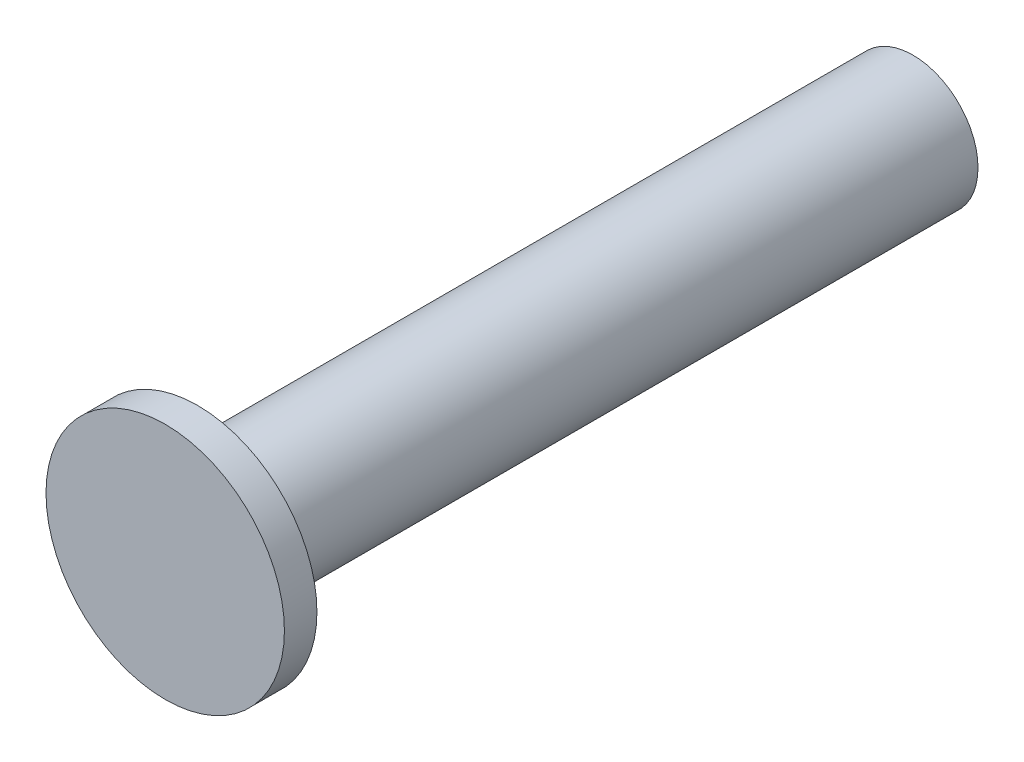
ISO-10303-21;
HEADER;
FILE_DESCRIPTION(('STEP AP214'),'2;1');
FILE_NAME('part.step','',(''),(''),'','','');
FILE_SCHEMA(('AUTOMOTIVE_DESIGN { 1 0 10303 214 1 1 1 1 }'));
ENDSEC;
DATA;
#1=APPLICATION_CONTEXT('core data for automotive mechanical design processes');
#2=APPLICATION_PROTOCOL_DEFINITION('international standard','automotive_design',2000,#1);
#3=PRODUCT_CONTEXT('',#1,'mechanical');
#4=PRODUCT('Part','Part','',(#3));
#5=PRODUCT_RELATED_PRODUCT_CATEGORY('part','',(#4));
#6=PRODUCT_DEFINITION_FORMATION('','',#4);
#7=PRODUCT_DEFINITION_CONTEXT('part definition',#1,'design');
#8=PRODUCT_DEFINITION('design','',#6,#7);
#9=PRODUCT_DEFINITION_SHAPE('','',#8);
#10=(LENGTH_UNIT() NAMED_UNIT(*) SI_UNIT(.MILLI.,.METRE.));
#11=(NAMED_UNIT(*) PLANE_ANGLE_UNIT() SI_UNIT($,.RADIAN.));
#12=(NAMED_UNIT(*) SI_UNIT($,.STERADIAN.) SOLID_ANGLE_UNIT());
#13=UNCERTAINTY_MEASURE_WITH_UNIT(LENGTH_MEASURE(1.E-05),#10,'distance_accuracy_value','');
#14=(GEOMETRIC_REPRESENTATION_CONTEXT(3) GLOBAL_UNCERTAINTY_ASSIGNED_CONTEXT((#13)) GLOBAL_UNIT_ASSIGNED_CONTEXT((#10,
#11,#12)) REPRESENTATION_CONTEXT('',''));
#15=CARTESIAN_POINT('',(0.,0.,0.));
#16=DIRECTION('',(0.,0.,1.));
#17=DIRECTION('',(1.,0.,0.));
#18=AXIS2_PLACEMENT_3D('',#15,#16,#17);
#19=CARTESIAN_POINT('',(0.,0.,33.));
#20=DIRECTION('',(0.,0.,-1.));
#21=DIRECTION('',(-1.,0.,0.));
#22=AXIS2_PLACEMENT_3D('',#19,#20,#21);
#23=CYLINDRICAL_SURFACE('',#22,3.);
#24=CARTESIAN_POINT('',(0.,0.,33.));
#25=DIRECTION('',(0.,0.,1.));
#26=DIRECTION('',(1.,0.,0.));
#27=AXIS2_PLACEMENT_3D('',#24,#25,#26);
#28=CIRCLE('',#27,3.);
#29=CARTESIAN_POINT('',(3.,0.,33.));
#30=VERTEX_POINT('',#29);
#31=EDGE_CURVE('E10',#30,#30,#28,.T.);
#32=ORIENTED_EDGE('',*,*,#31,.F.);
#33=EDGE_LOOP('',(#32));
#34=FACE_BOUND('',#33,.T.);
#35=CARTESIAN_POINT('',(0.,0.,0.));
#36=DIRECTION('',(0.,0.,1.));
#37=DIRECTION('',(1.,0.,0.));
#38=AXIS2_PLACEMENT_3D('',#35,#36,#37);
#39=CIRCLE('',#38,3.);
#40=CARTESIAN_POINT('',(3.,0.,0.));
#41=VERTEX_POINT('',#40);
#42=EDGE_CURVE('E34',#41,#41,#39,.T.);
#43=ORIENTED_EDGE('',*,*,#42,.T.);
#44=EDGE_LOOP('',(#43));
#45=FACE_BOUND('',#44,.T.);
#46=ADVANCED_FACE('F31',(#34,#45),#23,.T.);
#47=CARTESIAN_POINT('',(0.,0.,0.));
#48=DIRECTION('',(0.,0.,1.));
#49=DIRECTION('',(1.,0.,0.));
#50=AXIS2_PLACEMENT_3D('',#47,#48,#49);
#51=PLANE('',#50);
#52=ORIENTED_EDGE('',*,*,#42,.F.);
#53=EDGE_LOOP('',(#52));
#54=FACE_BOUND('',#53,.T.);
#55=ADVANCED_FACE('F54',(#54),#51,.F.);
#56=CARTESIAN_POINT('',(0.,0.,34.5));
#57=DIRECTION('',(0.,0.,-1.));
#58=DIRECTION('',(-1.,0.,0.));
#59=AXIS2_PLACEMENT_3D('',#56,#57,#58);
#60=CYLINDRICAL_SURFACE('',#59,5.5);
#61=CARTESIAN_POINT('',(0.,0.,34.5));
#62=DIRECTION('',(0.,0.,1.));
#63=DIRECTION('',(1.,0.,0.));
#64=AXIS2_PLACEMENT_3D('',#61,#62,#63);
#65=CIRCLE('',#64,5.5);
#66=CARTESIAN_POINT('',(5.5,0.,34.5));
#67=VERTEX_POINT('',#66);
#68=EDGE_CURVE('E41',#67,#67,#65,.T.);
#69=ORIENTED_EDGE('',*,*,#68,.F.);
#70=EDGE_LOOP('',(#69));
#71=FACE_BOUND('',#70,.T.);
#72=CARTESIAN_POINT('',(0.,0.,33.));
#73=DIRECTION('',(0.,0.,1.));
#74=DIRECTION('',(1.,0.,0.));
#75=AXIS2_PLACEMENT_3D('',#72,#73,#74);
#76=CIRCLE('',#75,5.5);
#77=CARTESIAN_POINT('',(5.5,0.,33.));
#78=VERTEX_POINT('',#77);
#79=EDGE_CURVE('E43',#78,#78,#76,.T.);
#80=ORIENTED_EDGE('',*,*,#79,.T.);
#81=EDGE_LOOP('',(#80));
#82=FACE_BOUND('',#81,.T.);
#83=ADVANCED_FACE('F51',(#71,#82),#60,.T.);
#84=CARTESIAN_POINT('',(0.,0.,34.5));
#85=DIRECTION('',(0.,0.,1.));
#86=DIRECTION('',(1.,0.,0.));
#87=AXIS2_PLACEMENT_3D('',#84,#85,#86);
#88=PLANE('',#87);
#89=ORIENTED_EDGE('',*,*,#68,.T.);
#90=EDGE_LOOP('',(#89));
#91=FACE_BOUND('',#90,.T.);
#92=ADVANCED_FACE('F49',(#91),#88,.T.);
#93=CARTESIAN_POINT('',(0.,0.,33.));
#94=DIRECTION('',(0.,0.,1.));
#95=DIRECTION('',(1.,0.,0.));
#96=AXIS2_PLACEMENT_3D('',#93,#94,#95);
#97=PLANE('',#96);
#98=ORIENTED_EDGE('',*,*,#31,.T.);
#99=EDGE_LOOP('',(#98));
#100=FACE_BOUND('',#99,.T.);
#101=ORIENTED_EDGE('',*,*,#79,.F.);
#102=EDGE_LOOP('',(#101));
#103=FACE_BOUND('',#102,.T.);
#104=ADVANCED_FACE('F58',(#100,#103),#97,.F.);
#105=CLOSED_SHELL('',(#46,#55,#83,#92,#104));
#106=MANIFOLD_SOLID_BREP('B2',#105);
#107=ADVANCED_BREP_SHAPE_REPRESENTATION('',(#18,#106),#14);
#108=SHAPE_DEFINITION_REPRESENTATION(#9,#107);
ENDSEC;
END-ISO-10303-21;
